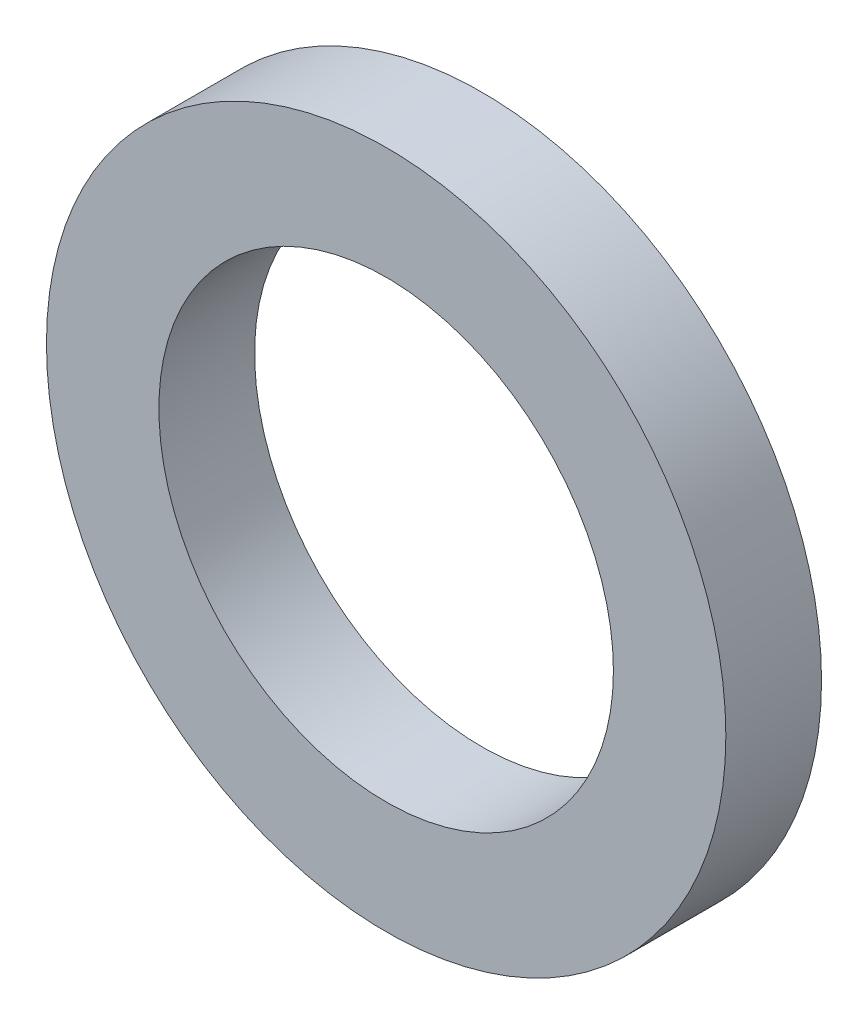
from build123d import *

# Parameters (mm, degrees)
ESQUISSE1_R      = 7.1
ESQUISSE1_R_2    = 4.75
EXTRUSION1_DEPTH = 2


with BuildPart() as part:
    # Esquisse1 → Extrusion1 (new body)
    with BuildSketch(Plane.XY):
        Circle(ESQUISSE1_R)
        Circle(ESQUISSE1_R_2, mode=Mode.SUBTRACT)
    extrude(amount=EXTRUSION1_DEPTH)


solid = part.part
